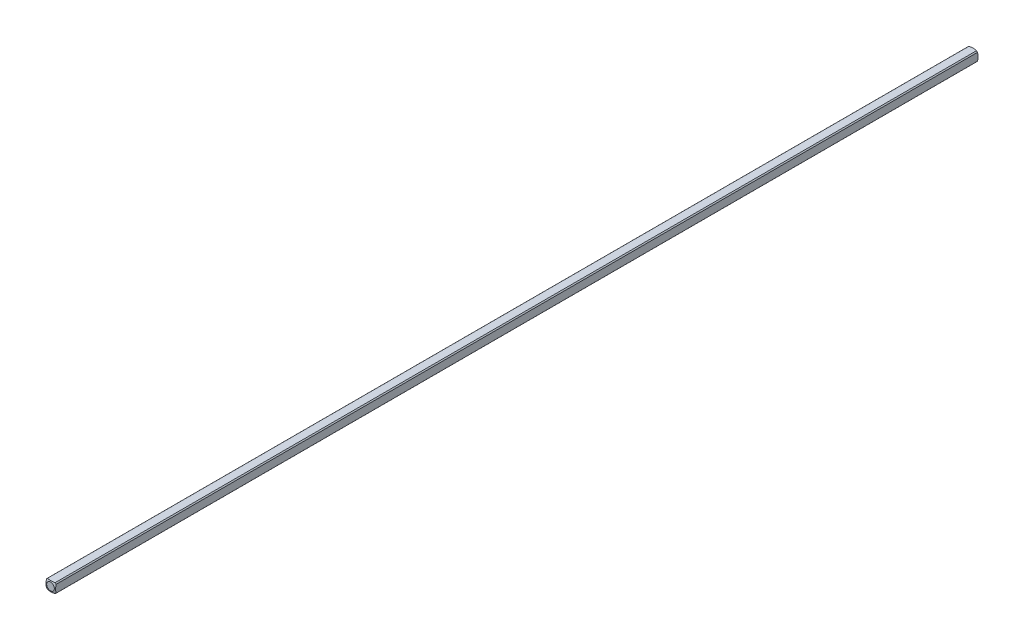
from build123d import *

# Parameters (mm, degrees)
SKETCH1_W           = 3.175
SKETCH1_H           = 3.175
BOSS_EXTRUDE1_DEPTH = 152.4
SKETCH2_OUTSIDE_W   = 35.668
SKETCH2_OUTSIDE_H   = 35.668
SKETCH2_OUTSIDE_R   = 2.032
CUT_EXTRUDE1_DEPTH  = 153.416535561


with BuildPart() as part:
    # Sketch1 → Boss-Extrude1 (new body)
    with BuildSketch(Plane.XY):
        Rectangle(SKETCH1_W, SKETCH1_H)
    extrude(amount=BOSS_EXTRUDE1_DEPTH)

    # Sketch2 outside → Cut-Extrude1 (cut, through all)
    with BuildSketch(Plane(origin=(0, 0, 0), x_dir=(-1, 0, 0), z_dir=(0, 0, -1))):
        Rectangle(SKETCH2_OUTSIDE_W, SKETCH2_OUTSIDE_H)
        Circle(SKETCH2_OUTSIDE_R, mode=Mode.SUBTRACT)
    extrude(amount=-CUT_EXTRUDE1_DEPTH, mode=Mode.SUBTRACT)

    # Sketch3 → Cut-Revolve1 (revolve, cut)
    with BuildSketch(Plane(origin=(0, 0, 0), x_dir=(1, 0, 0), z_dir=(0, 1, 0))):
        with BuildLine():
            Line((-5.053685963, -4.40273269), (-5.053685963, 5.740530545))
            Line((-5.053685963, 5.740530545), (0, 5.740530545))
            Line((0, 5.740530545), (0, 0.160877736))
            ThreePointArc((0, 0.160877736), (-3.404639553, -1.148866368), (-5.053685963, -4.40273269))
        make_face()
    revolve(axis=Axis((0, 0, 152.4), (0, 0, -1)), mode=Mode.SUBTRACT)

    # Mirror1: part across plane


with BuildPart() as part_1:
    add(part.part)
    add(part.part.mirror(Plane(origin=(0, 0, 152.4), x_dir=(1, 0, 0), z_dir=(0, 0, -1))))


solid = part_1.part
